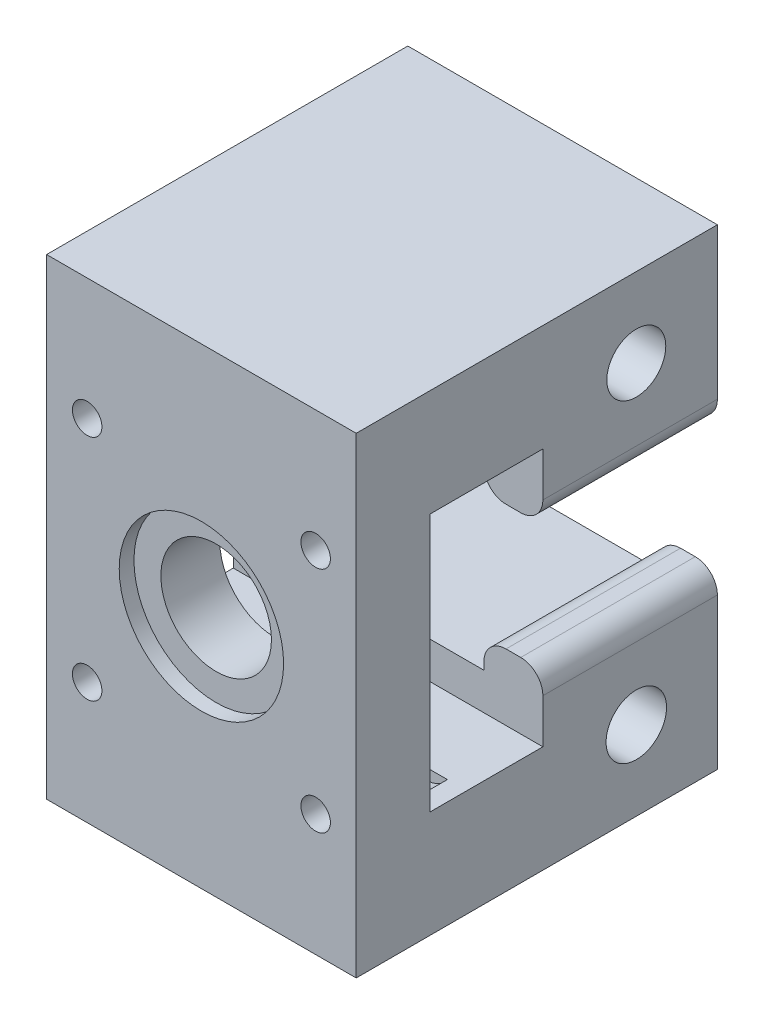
ISO-10303-21;
HEADER;
FILE_DESCRIPTION(('STEP AP214'),'2;1');
FILE_NAME('part.step','',(''),(''),'','','');
FILE_SCHEMA(('AUTOMOTIVE_DESIGN { 1 0 10303 214 1 1 1 1 }'));
ENDSEC;
DATA;
#1=APPLICATION_CONTEXT('core data for automotive mechanical design processes');
#2=APPLICATION_PROTOCOL_DEFINITION('international standard','automotive_design',2000,#1);
#3=PRODUCT_CONTEXT('',#1,'mechanical');
#4=PRODUCT('Part','Part','',(#3));
#5=PRODUCT_RELATED_PRODUCT_CATEGORY('part','',(#4));
#6=PRODUCT_DEFINITION_FORMATION('','',#4);
#7=PRODUCT_DEFINITION_CONTEXT('part definition',#1,'design');
#8=PRODUCT_DEFINITION('design','',#6,#7);
#9=PRODUCT_DEFINITION_SHAPE('','',#8);
#10=(LENGTH_UNIT() NAMED_UNIT(*) SI_UNIT(.MILLI.,.METRE.));
#11=(NAMED_UNIT(*) PLANE_ANGLE_UNIT() SI_UNIT($,.RADIAN.));
#12=(NAMED_UNIT(*) SI_UNIT($,.STERADIAN.) SOLID_ANGLE_UNIT());
#13=UNCERTAINTY_MEASURE_WITH_UNIT(LENGTH_MEASURE(1.E-05),#10,'distance_accuracy_value','');
#14=(GEOMETRIC_REPRESENTATION_CONTEXT(3) GLOBAL_UNCERTAINTY_ASSIGNED_CONTEXT((#13)) GLOBAL_UNIT_ASSIGNED_CONTEXT((#10,
#11,#12)) REPRESENTATION_CONTEXT('',''));
#15=CARTESIAN_POINT('',(0.,0.,0.));
#16=DIRECTION('',(0.,0.,1.));
#17=DIRECTION('',(1.,0.,0.));
#18=AXIS2_PLACEMENT_3D('',#15,#16,#17);
#19=CARTESIAN_POINT('',(75.2161760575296,-30.6161590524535,0.));
#20=DIRECTION('',(0.,-1.,0.));
#21=DIRECTION('',(1.,0.,0.));
#22=AXIS2_PLACEMENT_3D('',#19,#20,#21);
#23=PLANE('',#22);
#24=DIRECTION('',(0.,0.,1.));
#25=VECTOR('',#24,1.);
#26=CARTESIAN_POINT('',(72.5884073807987,-30.6161590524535,5.));
#27=LINE('',#26,#25);
#28=CARTESIAN_POINT('',(72.5884073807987,-30.6161590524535,10.));
#29=VERTEX_POINT('',#28);
#30=CARTESIAN_POINT('',(72.5884073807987,-30.6161590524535,5.));
#31=VERTEX_POINT('',#30);
#32=EDGE_CURVE('E225',#29,#31,#27,.F.);
#33=ORIENTED_EDGE('',*,*,#32,.F.);
#34=DIRECTION('',(-1.,0.,0.));
#35=VECTOR('',#34,1.);
#36=CARTESIAN_POINT('',(75.2161260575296,-30.6161590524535,10.));
#37=LINE('',#36,#35);
#38=CARTESIAN_POINT('',(75.2161260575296,-30.6161590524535,10.));
#39=VERTEX_POINT('',#38);
#40=EDGE_CURVE('E237',#39,#29,#37,.T.);
#41=ORIENTED_EDGE('',*,*,#40,.F.);
#42=DIRECTION('',(0.,0.,1.));
#43=VECTOR('',#42,1.);
#44=CARTESIAN_POINT('',(75.2161260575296,-30.6161590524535,10.));
#45=LINE('',#44,#43);
#46=CARTESIAN_POINT('',(75.2161260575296,-30.6161590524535,-5.32347531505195));
#47=VERTEX_POINT('',#46);
#48=EDGE_CURVE('E374',#47,#39,#45,.T.);
#49=ORIENTED_EDGE('',*,*,#48,.F.);
#50=DIRECTION('',(-1.,0.,0.));
#51=VECTOR('',#50,1.);
#52=CARTESIAN_POINT('',(75.2161760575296,-30.6161590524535,-5.32347531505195));
#53=LINE('',#52,#51);
#54=CARTESIAN_POINT('',(33.2161260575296,-30.6161590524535,-5.32347531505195));
#55=VERTEX_POINT('',#54);
#56=EDGE_CURVE('E341',#47,#55,#53,.T.);
#57=ORIENTED_EDGE('',*,*,#56,.T.);
#58=DIRECTION('',(0.,0.,1.));
#59=VECTOR('',#58,1.);
#60=CARTESIAN_POINT('',(33.2161260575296,-30.6161590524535,0.));
#61=LINE('',#60,#59);
#62=CARTESIAN_POINT('',(33.2161260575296,-30.6161590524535,10.));
#63=VERTEX_POINT('',#62);
#64=EDGE_CURVE('E338',#55,#63,#61,.T.);
#65=ORIENTED_EDGE('',*,*,#64,.T.);
#66=CARTESIAN_POINT('',(35.8438447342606,-30.6161590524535,10.));
#67=VERTEX_POINT('',#66);
#68=EDGE_CURVE('E248',#67,#63,#37,.T.);
#69=ORIENTED_EDGE('',*,*,#68,.F.);
#70=DIRECTION('',(0.,0.,1.));
#71=VECTOR('',#70,1.);
#72=CARTESIAN_POINT('',(35.8438447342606,-30.6161590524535,5.));
#73=LINE('',#72,#71);
#74=CARTESIAN_POINT('',(35.8438447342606,-30.6161590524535,5.));
#75=VERTEX_POINT('',#74);
#76=EDGE_CURVE('E321',#75,#67,#73,.T.);
#77=ORIENTED_EDGE('',*,*,#76,.F.);
#78=DIRECTION('',(1.,0.,0.));
#79=VECTOR('',#78,1.);
#80=CARTESIAN_POINT('',(75.2161760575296,-30.6161590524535,5.));
#81=LINE('',#80,#79);
#82=CARTESIAN_POINT('',(41.5884073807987,-30.6161590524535,5.));
#83=VERTEX_POINT('',#82);
#84=EDGE_CURVE('E44',#75,#83,#81,.T.);
#85=ORIENTED_EDGE('',*,*,#84,.T.);
#86=DIRECTION('',(0.,0.,1.));
#87=VECTOR('',#86,1.);
#88=CARTESIAN_POINT('',(41.5884073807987,-30.6161590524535,5.));
#89=LINE('',#88,#87);
#90=CARTESIAN_POINT('',(41.5884073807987,-30.6161590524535,10.));
#91=VERTEX_POINT('',#90);
#92=EDGE_CURVE('E317',#91,#83,#89,.F.);
#93=ORIENTED_EDGE('',*,*,#92,.F.);
#94=CARTESIAN_POINT('',(66.8438447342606,-30.6161590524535,10.));
#95=VERTEX_POINT('',#94);
#96=EDGE_CURVE('E246',#95,#91,#37,.T.);
#97=ORIENTED_EDGE('',*,*,#96,.F.);
#98=DIRECTION('',(0.,0.,1.));
#99=VECTOR('',#98,1.);
#100=CARTESIAN_POINT('',(66.8438447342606,-30.6161590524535,5.));
#101=LINE('',#100,#99);
#102=CARTESIAN_POINT('',(66.8438447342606,-30.6161590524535,5.));
#103=VERTEX_POINT('',#102);
#104=EDGE_CURVE('E228',#103,#95,#101,.T.);
#105=ORIENTED_EDGE('',*,*,#104,.F.);
#106=DIRECTION('',(1.,0.,0.));
#107=VECTOR('',#106,1.);
#108=CARTESIAN_POINT('',(75.2161760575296,-30.6161590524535,5.));
#109=LINE('',#108,#107);
#110=EDGE_CURVE('E12',#103,#31,#109,.T.);
#111=ORIENTED_EDGE('',*,*,#110,.T.);
#112=EDGE_LOOP('',(#33,#41,#49,#57,#65,#69,#77,#85,#93,#97,#105,#111));
#113=FACE_BOUND('',#112,.T.);
#114=ADVANCED_FACE('F36',(#113),#23,.F.);
#115=CARTESIAN_POINT('',(75.2161760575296,4.38384094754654,0.));
#116=DIRECTION('',(0.,1.,0.));
#117=DIRECTION('',(-1.,0.,0.));
#118=AXIS2_PLACEMENT_3D('',#115,#116,#117);
#119=PLANE('',#118);
#120=DIRECTION('',(0.,0.,1.));
#121=VECTOR('',#120,1.);
#122=CARTESIAN_POINT('',(35.8438447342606,4.38384094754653,5.));
#123=LINE('',#122,#121);
#124=CARTESIAN_POINT('',(35.8438447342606,4.38384094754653,10.));
#125=VERTEX_POINT('',#124);
#126=CARTESIAN_POINT('',(35.8438447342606,4.38384094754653,5.));
#127=VERTEX_POINT('',#126);
#128=EDGE_CURVE('E307',#125,#127,#123,.F.);
#129=ORIENTED_EDGE('',*,*,#128,.F.);
#130=DIRECTION('',(1.,0.,0.));
#131=VECTOR('',#130,1.);
#132=CARTESIAN_POINT('',(75.2161260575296,4.38384094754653,10.));
#133=LINE('',#132,#131);
#134=CARTESIAN_POINT('',(33.2161260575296,4.38384094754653,10.));
#135=VERTEX_POINT('',#134);
#136=EDGE_CURVE('E354',#135,#125,#133,.T.);
#137=ORIENTED_EDGE('',*,*,#136,.F.);
#138=DIRECTION('',(0.,0.,-1.));
#139=VECTOR('',#138,1.);
#140=CARTESIAN_POINT('',(33.2161260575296,4.38384094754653,0.));
#141=LINE('',#140,#139);
#142=CARTESIAN_POINT('',(33.2161260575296,4.38384094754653,-5.32347531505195));
#143=VERTEX_POINT('',#142);
#144=EDGE_CURVE('E351',#135,#143,#141,.T.);
#145=ORIENTED_EDGE('',*,*,#144,.T.);
#146=DIRECTION('',(-1.,0.,0.));
#147=VECTOR('',#146,1.);
#148=CARTESIAN_POINT('',(75.2161760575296,4.38384094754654,-5.32347531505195));
#149=LINE('',#148,#147);
#150=CARTESIAN_POINT('',(75.2161260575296,4.38384094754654,-5.32347531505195));
#151=VERTEX_POINT('',#150);
#152=EDGE_CURVE('E344',#151,#143,#149,.T.);
#153=ORIENTED_EDGE('',*,*,#152,.F.);
#154=DIRECTION('',(0.,0.,-1.));
#155=VECTOR('',#154,1.);
#156=CARTESIAN_POINT('',(75.2161260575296,4.38384094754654,10.));
#157=LINE('',#156,#155);
#158=CARTESIAN_POINT('',(75.2161260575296,4.38384094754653,10.));
#159=VERTEX_POINT('',#158);
#160=EDGE_CURVE('E371',#159,#151,#157,.T.);
#161=ORIENTED_EDGE('',*,*,#160,.F.);
#162=CARTESIAN_POINT('',(72.5241723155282,4.38384094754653,10.));
#163=VERTEX_POINT('',#162);
#164=EDGE_CURVE('E250',#163,#159,#133,.T.);
#165=ORIENTED_EDGE('',*,*,#164,.F.);
#166=DIRECTION('',(0.,0.,1.));
#167=VECTOR('',#166,1.);
#168=CARTESIAN_POINT('',(72.5241723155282,4.38384094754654,5.));
#169=LINE('',#168,#167);
#170=CARTESIAN_POINT('',(72.5241723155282,4.38384094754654,5.));
#171=VERTEX_POINT('',#170);
#172=EDGE_CURVE('E301',#171,#163,#169,.T.);
#173=ORIENTED_EDGE('',*,*,#172,.F.);
#174=DIRECTION('',(-1.,0.,0.));
#175=VECTOR('',#174,1.);
#176=CARTESIAN_POINT('',(75.2161760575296,4.38384094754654,5.));
#177=LINE('',#176,#175);
#178=CARTESIAN_POINT('',(66.9080797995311,4.38384094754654,5.));
#179=VERTEX_POINT('',#178);
#180=EDGE_CURVE('E422',#171,#179,#177,.T.);
#181=ORIENTED_EDGE('',*,*,#180,.T.);
#182=DIRECTION('',(0.,0.,1.));
#183=VECTOR('',#182,1.);
#184=CARTESIAN_POINT('',(66.9080797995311,4.38384094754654,5.));
#185=LINE('',#184,#183);
#186=CARTESIAN_POINT('',(66.9080797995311,4.38384094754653,10.));
#187=VERTEX_POINT('',#186);
#188=EDGE_CURVE('E297',#187,#179,#185,.F.);
#189=ORIENTED_EDGE('',*,*,#188,.F.);
#190=CARTESIAN_POINT('',(41.5884073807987,4.38384094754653,10.));
#191=VERTEX_POINT('',#190);
#192=EDGE_CURVE('E361',#191,#187,#133,.T.);
#193=ORIENTED_EDGE('',*,*,#192,.F.);
#194=DIRECTION('',(0.,0.,1.));
#195=VECTOR('',#194,1.);
#196=CARTESIAN_POINT('',(41.5884073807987,4.38384094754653,5.));
#197=LINE('',#196,#195);
#198=CARTESIAN_POINT('',(41.5884073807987,4.38384094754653,5.));
#199=VERTEX_POINT('',#198);
#200=EDGE_CURVE('E311',#199,#191,#197,.T.);
#201=ORIENTED_EDGE('',*,*,#200,.F.);
#202=DIRECTION('',(-1.,0.,0.));
#203=VECTOR('',#202,1.);
#204=CARTESIAN_POINT('',(75.2161760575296,4.38384094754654,5.));
#205=LINE('',#204,#203);
#206=EDGE_CURVE('E425',#199,#127,#205,.T.);
#207=ORIENTED_EDGE('',*,*,#206,.T.);
#208=EDGE_LOOP('',(#129,#137,#145,#153,#161,#165,#173,#181,#189,#193,#201,#207));
#209=FACE_BOUND('',#208,.T.);
#210=ADVANCED_FACE('F357',(#209),#119,.F.);
#211=CARTESIAN_POINT('',(33.2161260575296,18.8838409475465,10.));
#212=DIRECTION('',(1.,0.,0.));
#213=DIRECTION('',(0.,1.,0.));
#214=AXIS2_PLACEMENT_3D('',#211,#212,#213);
#215=PLANE('',#214);
#216=CARTESIAN_POINT('',(33.2161260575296,-34.3661590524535,-18.));
#217=DIRECTION('',(1.,0.,0.));
#218=DIRECTION('',(0.,0.,-1.));
#219=AXIS2_PLACEMENT_3D('',#216,#217,#218);
#220=CIRCLE('',#219,4.1);
#221=CARTESIAN_POINT('',(33.2161260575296,-34.3661590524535,-22.1));
#222=VERTEX_POINT('',#221);
#223=EDGE_CURVE('E543',#222,#222,#220,.T.);
#224=ORIENTED_EDGE('',*,*,#223,.T.);
#225=EDGE_LOOP('',(#224));
#226=FACE_BOUND('',#225,.T.);
#227=CARTESIAN_POINT('',(33.2161260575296,8.13384094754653,-18.));
#228=DIRECTION('',(1.,0.,0.));
#229=DIRECTION('',(0.,0.,-1.));
#230=AXIS2_PLACEMENT_3D('',#227,#228,#229);
#231=CIRCLE('',#230,4.);
#232=CARTESIAN_POINT('',(33.2161260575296,8.13384094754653,-22.));
#233=VERTEX_POINT('',#232);
#234=EDGE_CURVE('E549',#233,#233,#231,.T.);
#235=ORIENTED_EDGE('',*,*,#234,.T.);
#236=EDGE_LOOP('',(#235));
#237=FACE_BOUND('',#236,.T.);
#238=DIRECTION('',(0.,0.,-1.));
#239=VECTOR('',#238,1.);
#240=CARTESIAN_POINT('',(33.2161260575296,-0.61615905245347,10.));
#241=LINE('',#240,#239);
#242=CARTESIAN_POINT('',(33.2161260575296,-0.616159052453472,-5.32347531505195));
#243=VERTEX_POINT('',#242);
#244=CARTESIAN_POINT('',(33.2161260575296,-0.61615905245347,-29.));
#245=VERTEX_POINT('',#244);
#246=EDGE_CURVE('E272',#243,#245,#241,.T.);
#247=ORIENTED_EDGE('',*,*,#246,.F.);
#248=DIRECTION('',(0.,-1.,0.));
#249=VECTOR('',#248,1.);
#250=CARTESIAN_POINT('',(33.2161260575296,4.38384094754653,-5.32347531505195));
#251=LINE('',#250,#249);
#252=EDGE_CURVE('E345',#143,#243,#251,.T.);
#253=ORIENTED_EDGE('',*,*,#252,.F.);
#254=ORIENTED_EDGE('',*,*,#144,.F.);
#255=DIRECTION('',(0.,1.,0.));
#256=VECTOR('',#255,1.);
#257=CARTESIAN_POINT('',(33.2161260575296,-30.6161590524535,10.));
#258=LINE('',#257,#256);
#259=EDGE_CURVE('E245',#63,#135,#258,.T.);
#260=ORIENTED_EDGE('',*,*,#259,.F.);
#261=ORIENTED_EDGE('',*,*,#64,.F.);
#262=CARTESIAN_POINT('',(33.2161260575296,-25.6161590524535,-5.32347531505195));
#263=VERTEX_POINT('',#262);
#264=EDGE_CURVE('E555',#263,#55,#251,.T.);
#265=ORIENTED_EDGE('',*,*,#264,.F.);
#266=DIRECTION('',(0.,0.,1.));
#267=VECTOR('',#266,1.);
#268=CARTESIAN_POINT('',(33.2161260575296,-25.6161590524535,10.));
#269=LINE('',#268,#267);
#270=CARTESIAN_POINT('',(33.2161260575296,-25.6161590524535,-29.));
#271=VERTEX_POINT('',#270);
#272=EDGE_CURVE('E269',#271,#263,#269,.T.);
#273=ORIENTED_EDGE('',*,*,#272,.F.);
#274=DIRECTION('',(0.,1.,0.));
#275=VECTOR('',#274,1.);
#276=CARTESIAN_POINT('',(33.2161260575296,-27.1161590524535,-29.));
#277=LINE('',#276,#275);
#278=CARTESIAN_POINT('',(33.2161260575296,-45.1161590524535,-29.));
#279=VERTEX_POINT('',#278);
#280=EDGE_CURVE('E539',#279,#271,#277,.T.);
#281=ORIENTED_EDGE('',*,*,#280,.F.);
#282=DIRECTION('',(0.,0.,-1.));
#283=VECTOR('',#282,1.);
#284=CARTESIAN_POINT('',(33.2161260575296,-45.1161590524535,10.));
#285=LINE('',#284,#283);
#286=CARTESIAN_POINT('',(33.2161260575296,-45.1161590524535,20.));
#287=VERTEX_POINT('',#286);
#288=EDGE_CURVE('E375',#287,#279,#285,.T.);
#289=ORIENTED_EDGE('',*,*,#288,.F.);
#290=DIRECTION('',(0.,-1.,0.));
#291=VECTOR('',#290,1.);
#292=CARTESIAN_POINT('',(33.2161260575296,-45.1161590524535,20.));
#293=LINE('',#292,#291);
#294=CARTESIAN_POINT('',(33.2161260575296,18.8838409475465,20.));
#295=VERTEX_POINT('',#294);
#296=EDGE_CURVE('E360',#295,#287,#293,.T.);
#297=ORIENTED_EDGE('',*,*,#296,.F.);
#298=DIRECTION('',(0.,0.,-1.));
#299=VECTOR('',#298,1.);
#300=CARTESIAN_POINT('',(33.2161260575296,18.8838409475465,10.));
#301=LINE('',#300,#299);
#302=CARTESIAN_POINT('',(33.2161260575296,18.8838409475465,-29.));
#303=VERTEX_POINT('',#302);
#304=EDGE_CURVE('E562',#295,#303,#301,.T.);
#305=ORIENTED_EDGE('',*,*,#304,.T.);
#306=DIRECTION('',(0.,1.,0.));
#307=VECTOR('',#306,1.);
#308=CARTESIAN_POINT('',(33.2161260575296,18.8838409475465,-29.));
#309=LINE('',#308,#307);
#310=EDGE_CURVE('E527',#245,#303,#309,.T.);
#311=ORIENTED_EDGE('',*,*,#310,.F.);
#312=EDGE_LOOP('',(#247,#253,#254,#260,#261,#265,#273,#281,#289,#297,#305,#311));
#313=FACE_BOUND('',#312,.T.);
#314=ADVANCED_FACE('F348',(#226,#237,#313),#215,.F.);
#315=CARTESIAN_POINT('',(75.2161760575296,4.38384094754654,-5.32347531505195));
#316=DIRECTION('',(0.,0.,-1.));
#317=DIRECTION('',(0.,1.,0.));
#318=AXIS2_PLACEMENT_3D('',#315,#316,#317);
#319=PLANE('',#318);
#320=ORIENTED_EDGE('',*,*,#252,.T.);
#321=DIRECTION('',(-1.,0.,0.));
#322=VECTOR('',#321,1.);
#323=CARTESIAN_POINT('',(33.2161260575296,-0.616159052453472,-5.32347531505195));
#324=LINE('',#323,#322);
#325=CARTESIAN_POINT('',(67.2161260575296,-0.616159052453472,-5.32347531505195));
#326=VERTEX_POINT('',#325);
#327=EDGE_CURVE('E525',#326,#243,#324,.T.);
#328=ORIENTED_EDGE('',*,*,#327,.F.);
#329=DIRECTION('',(0.,1.,0.));
#330=VECTOR('',#329,1.);
#331=CARTESIAN_POINT('',(67.2161260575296,-4.61615905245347,-5.32347531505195));
#332=LINE('',#331,#330);
#333=CARTESIAN_POINT('',(67.2161260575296,-1.61615905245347,-5.32347531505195));
#334=VERTEX_POINT('',#333);
#335=EDGE_CURVE('E509',#334,#326,#332,.T.);
#336=ORIENTED_EDGE('',*,*,#335,.F.);
#337=CARTESIAN_POINT('',(70.2161260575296,-1.61615905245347,-5.32347531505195));
#338=DIRECTION('',(0.,0.,-1.));
#339=DIRECTION('',(0.,1.,0.));
#340=AXIS2_PLACEMENT_3D('',#337,#338,#339);
#341=CIRCLE('',#340,3.);
#342=CARTESIAN_POINT('',(70.2161260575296,-4.61615905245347,-5.32347531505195));
#343=VERTEX_POINT('',#342);
#344=EDGE_CURVE('E410',#334,#343,#341,.F.);
#345=ORIENTED_EDGE('',*,*,#344,.T.);
#346=DIRECTION('',(-1.,0.,0.));
#347=VECTOR('',#346,1.);
#348=CARTESIAN_POINT('',(75.2161260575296,-4.61615905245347,-5.32347531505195));
#349=LINE('',#348,#347);
#350=CARTESIAN_POINT('',(72.2161260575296,-4.61615905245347,-5.32347531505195));
#351=VERTEX_POINT('',#350);
#352=EDGE_CURVE('E505',#351,#343,#349,.T.);
#353=ORIENTED_EDGE('',*,*,#352,.F.);
#354=CARTESIAN_POINT('',(72.2161260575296,-1.61615905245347,-5.32347531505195));
#355=DIRECTION('',(0.,0.,-1.));
#356=DIRECTION('',(0.,1.,0.));
#357=AXIS2_PLACEMENT_3D('',#354,#355,#356);
#358=CIRCLE('',#357,3.);
#359=CARTESIAN_POINT('',(75.2161260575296,-1.61615905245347,-5.32347531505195));
#360=VERTEX_POINT('',#359);
#361=EDGE_CURVE('E58',#351,#360,#358,.F.);
#362=ORIENTED_EDGE('',*,*,#361,.T.);
#363=DIRECTION('',(0.,-1.,0.));
#364=VECTOR('',#363,1.);
#365=CARTESIAN_POINT('',(75.2161260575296,18.8838409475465,-5.32347531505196));
#366=LINE('',#365,#364);
#367=EDGE_CURVE('E561',#151,#360,#366,.T.);
#368=ORIENTED_EDGE('',*,*,#367,.F.);
#369=ORIENTED_EDGE('',*,*,#152,.T.);
#370=EDGE_LOOP('',(#320,#328,#336,#345,#353,#362,#368,#369));
#371=FACE_BOUND('',#370,.T.);
#372=ADVANCED_FACE('F462',(#371),#319,.F.);
#373=CARTESIAN_POINT('',(0.,0.,-29.));
#374=DIRECTION('',(0.,0.,1.));
#375=DIRECTION('',(1.,0.,0.));
#376=AXIS2_PLACEMENT_3D('',#373,#374,#375);
#377=PLANE('',#376);
#378=DIRECTION('',(1.,0.,0.));
#379=VECTOR('',#378,1.);
#380=CARTESIAN_POINT('',(33.2161260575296,-0.616159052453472,-29.));
#381=LINE('',#380,#379);
#382=CARTESIAN_POINT('',(67.2161260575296,-0.616159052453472,-29.));
#383=VERTEX_POINT('',#382);
#384=EDGE_CURVE('E523',#245,#383,#381,.T.);
#385=ORIENTED_EDGE('',*,*,#384,.F.);
#386=ORIENTED_EDGE('',*,*,#310,.T.);
#387=DIRECTION('',(1.,0.,0.));
#388=VECTOR('',#387,1.);
#389=CARTESIAN_POINT('',(33.2161260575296,18.8838409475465,-29.));
#390=LINE('',#389,#388);
#391=CARTESIAN_POINT('',(75.2161260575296,18.8838409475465,-29.));
#392=VERTEX_POINT('',#391);
#393=EDGE_CURVE('E529',#303,#392,#390,.T.);
#394=ORIENTED_EDGE('',*,*,#393,.T.);
#395=DIRECTION('',(0.,-1.,0.));
#396=VECTOR('',#395,1.);
#397=CARTESIAN_POINT('',(75.2161260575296,18.8838409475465,-29.));
#398=LINE('',#397,#396);
#399=CARTESIAN_POINT('',(75.2161260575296,-1.61615905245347,-29.));
#400=VERTEX_POINT('',#399);
#401=EDGE_CURVE('E532',#392,#400,#398,.T.);
#402=ORIENTED_EDGE('',*,*,#401,.T.);
#403=CARTESIAN_POINT('',(72.2161260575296,-1.61615905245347,-29.));
#404=DIRECTION('',(0.,0.,1.));
#405=DIRECTION('',(1.,0.,0.));
#406=AXIS2_PLACEMENT_3D('',#403,#404,#405);
#407=CIRCLE('',#406,3.);
#408=CARTESIAN_POINT('',(72.2161260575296,-4.61615905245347,-29.));
#409=VERTEX_POINT('',#408);
#410=EDGE_CURVE('E51',#400,#409,#407,.F.);
#411=ORIENTED_EDGE('',*,*,#410,.T.);
#412=DIRECTION('',(1.,0.,0.));
#413=VECTOR('',#412,1.);
#414=CARTESIAN_POINT('',(75.2161260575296,-4.61615905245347,-29.));
#415=LINE('',#414,#413);
#416=CARTESIAN_POINT('',(70.2161260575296,-4.61615905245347,-29.));
#417=VERTEX_POINT('',#416);
#418=EDGE_CURVE('E503',#417,#409,#415,.T.);
#419=ORIENTED_EDGE('',*,*,#418,.F.);
#420=CARTESIAN_POINT('',(70.2161260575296,-1.61615905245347,-29.));
#421=DIRECTION('',(0.,0.,1.));
#422=DIRECTION('',(1.,0.,0.));
#423=AXIS2_PLACEMENT_3D('',#420,#421,#422);
#424=CIRCLE('',#423,3.);
#425=CARTESIAN_POINT('',(67.2161260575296,-1.61615905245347,-29.));
#426=VERTEX_POINT('',#425);
#427=EDGE_CURVE('E413',#417,#426,#424,.F.);
#428=ORIENTED_EDGE('',*,*,#427,.T.);
#429=DIRECTION('',(0.,1.,0.));
#430=VECTOR('',#429,1.);
#431=CARTESIAN_POINT('',(67.2161260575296,-4.61615905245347,-29.));
#432=LINE('',#431,#430);
#433=EDGE_CURVE('E507',#426,#383,#432,.T.);
#434=ORIENTED_EDGE('',*,*,#433,.T.);
#435=EDGE_LOOP('',(#385,#386,#394,#402,#411,#419,#428,#434));
#436=FACE_BOUND('',#435,.T.);
#437=ADVANCED_FACE('F464',(#436),#377,.F.);
#438=DIRECTION('',(1.,0.,0.));
#439=VECTOR('',#438,1.);
#440=CARTESIAN_POINT('',(33.2161260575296,-25.6161590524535,-5.32347531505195));
#441=LINE('',#440,#439);
#442=CARTESIAN_POINT('',(67.2161260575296,-25.6161590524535,-5.32347531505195));
#443=VERTEX_POINT('',#442);
#444=EDGE_CURVE('E519',#263,#443,#441,.T.);
#445=ORIENTED_EDGE('',*,*,#444,.F.);
#446=ORIENTED_EDGE('',*,*,#264,.T.);
#447=ORIENTED_EDGE('',*,*,#56,.F.);
#448=CARTESIAN_POINT('',(75.2161260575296,-24.6161590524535,-5.32347531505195));
#449=VERTEX_POINT('',#448);
#450=EDGE_CURVE('E380',#449,#47,#366,.T.);
#451=ORIENTED_EDGE('',*,*,#450,.F.);
#452=CARTESIAN_POINT('',(72.2161260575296,-24.6161590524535,-5.32347531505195));
#453=DIRECTION('',(0.,0.,-1.));
#454=DIRECTION('',(0.,1.,0.));
#455=AXIS2_PLACEMENT_3D('',#452,#453,#454);
#456=CIRCLE('',#455,3.);
#457=CARTESIAN_POINT('',(72.2161260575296,-21.6161590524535,-5.32347531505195));
#458=VERTEX_POINT('',#457);
#459=EDGE_CURVE('E383',#449,#458,#456,.F.);
#460=ORIENTED_EDGE('',*,*,#459,.T.);
#461=DIRECTION('',(1.,0.,0.));
#462=VECTOR('',#461,1.);
#463=CARTESIAN_POINT('',(75.2161260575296,-21.6161590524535,-5.32347531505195));
#464=LINE('',#463,#462);
#465=CARTESIAN_POINT('',(70.2161260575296,-21.6161590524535,-5.32347531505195));
#466=VERTEX_POINT('',#465);
#467=EDGE_CURVE('E588',#466,#458,#464,.T.);
#468=ORIENTED_EDGE('',*,*,#467,.F.);
#469=CARTESIAN_POINT('',(70.2161260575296,-24.6161590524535,-5.32347531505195));
#470=DIRECTION('',(0.,0.,-1.));
#471=DIRECTION('',(0.,1.,0.));
#472=AXIS2_PLACEMENT_3D('',#469,#470,#471);
#473=CIRCLE('',#472,3.);
#474=CARTESIAN_POINT('',(67.2161260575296,-24.6161590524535,-5.32347531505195));
#475=VERTEX_POINT('',#474);
#476=EDGE_CURVE('E402',#466,#475,#473,.F.);
#477=ORIENTED_EDGE('',*,*,#476,.T.);
#478=DIRECTION('',(0.,-1.,0.));
#479=VECTOR('',#478,1.);
#480=CARTESIAN_POINT('',(67.2161260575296,-21.6161590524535,-5.32347531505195));
#481=LINE('',#480,#479);
#482=EDGE_CURVE('E587',#475,#443,#481,.T.);
#483=ORIENTED_EDGE('',*,*,#482,.T.);
#484=EDGE_LOOP('',(#445,#446,#447,#451,#460,#468,#477,#483));
#485=FACE_BOUND('',#484,.T.);
#486=ADVANCED_FACE('F466',(#485),#319,.F.);
#487=CARTESIAN_POINT('',(0.,0.,-29.));
#488=DIRECTION('',(0.,0.,-1.));
#489=DIRECTION('',(-1.,0.,0.));
#490=AXIS2_PLACEMENT_3D('',#487,#488,#489);
#491=PLANE('',#490);
#492=ORIENTED_EDGE('',*,*,#280,.T.);
#493=DIRECTION('',(-1.,0.,0.));
#494=VECTOR('',#493,1.);
#495=CARTESIAN_POINT('',(33.2161260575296,-25.6161590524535,-29.));
#496=LINE('',#495,#494);
#497=CARTESIAN_POINT('',(67.2161260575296,-25.6161590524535,-29.));
#498=VERTEX_POINT('',#497);
#499=EDGE_CURVE('E521',#498,#271,#496,.T.);
#500=ORIENTED_EDGE('',*,*,#499,.F.);
#501=DIRECTION('',(0.,-1.,0.));
#502=VECTOR('',#501,1.);
#503=CARTESIAN_POINT('',(67.2161260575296,-21.6161590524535,-29.));
#504=LINE('',#503,#502);
#505=CARTESIAN_POINT('',(67.2161260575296,-24.6161590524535,-29.));
#506=VERTEX_POINT('',#505);
#507=EDGE_CURVE('E516',#506,#498,#504,.T.);
#508=ORIENTED_EDGE('',*,*,#507,.F.);
#509=CARTESIAN_POINT('',(70.2161260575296,-24.6161590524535,-29.));
#510=DIRECTION('',(0.,0.,-1.));
#511=DIRECTION('',(-1.,0.,0.));
#512=AXIS2_PLACEMENT_3D('',#509,#510,#511);
#513=CIRCLE('',#512,3.);
#514=CARTESIAN_POINT('',(70.2161260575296,-21.6161590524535,-29.));
#515=VERTEX_POINT('',#514);
#516=EDGE_CURVE('E400',#506,#515,#513,.T.);
#517=ORIENTED_EDGE('',*,*,#516,.T.);
#518=DIRECTION('',(-1.,0.,0.));
#519=VECTOR('',#518,1.);
#520=CARTESIAN_POINT('',(75.2161260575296,-21.6161590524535,-29.));
#521=LINE('',#520,#519);
#522=CARTESIAN_POINT('',(72.2161260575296,-21.6161590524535,-29.));
#523=VERTEX_POINT('',#522);
#524=EDGE_CURVE('E592',#523,#515,#521,.T.);
#525=ORIENTED_EDGE('',*,*,#524,.F.);
#526=CARTESIAN_POINT('',(72.2161260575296,-24.6161590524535,-29.));
#527=DIRECTION('',(0.,0.,-1.));
#528=DIRECTION('',(-1.,0.,0.));
#529=AXIS2_PLACEMENT_3D('',#526,#527,#528);
#530=CIRCLE('',#529,3.);
#531=CARTESIAN_POINT('',(75.2161260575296,-24.6161590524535,-29.));
#532=VERTEX_POINT('',#531);
#533=EDGE_CURVE('E392',#523,#532,#530,.T.);
#534=ORIENTED_EDGE('',*,*,#533,.T.);
#535=DIRECTION('',(0.,-1.,0.));
#536=VECTOR('',#535,1.);
#537=CARTESIAN_POINT('',(75.2161260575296,-27.1161590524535,-29.));
#538=LINE('',#537,#536);
#539=CARTESIAN_POINT('',(75.2161260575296,-45.1161590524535,-29.));
#540=VERTEX_POINT('',#539);
#541=EDGE_CURVE('E534',#532,#540,#538,.T.);
#542=ORIENTED_EDGE('',*,*,#541,.T.);
#543=DIRECTION('',(-1.,0.,0.));
#544=VECTOR('',#543,1.);
#545=CARTESIAN_POINT('',(75.2161260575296,-45.1161590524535,-29.));
#546=LINE('',#545,#544);
#547=EDGE_CURVE('E536',#540,#279,#546,.T.);
#548=ORIENTED_EDGE('',*,*,#547,.T.);
#549=EDGE_LOOP('',(#492,#500,#508,#517,#525,#534,#542,#548));
#550=FACE_BOUND('',#549,.T.);
#551=ADVANCED_FACE('F497',(#550),#491,.T.);
#552=CARTESIAN_POINT('',(72.2161260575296,-1.61615905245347,10.));
#553=DIRECTION('',(0.,0.,1.));
#554=DIRECTION('',(1.,0.,0.));
#555=AXIS2_PLACEMENT_3D('',#552,#553,#554);
#556=CYLINDRICAL_SURFACE('',#555,3.);
#557=DIRECTION('',(0.,0.,-1.));
#558=VECTOR('',#557,1.);
#559=CARTESIAN_POINT('',(75.2161260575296,-1.61615905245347,10.));
#560=LINE('',#559,#558);
#561=EDGE_CURVE('E415',#360,#400,#560,.T.);
#562=ORIENTED_EDGE('',*,*,#561,.F.);
#563=ORIENTED_EDGE('',*,*,#361,.F.);
#564=DIRECTION('',(0.,0.,-1.));
#565=VECTOR('',#564,1.);
#566=CARTESIAN_POINT('',(72.2161260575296,-4.61615905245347,10.));
#567=LINE('',#566,#565);
#568=EDGE_CURVE('E418',#409,#351,#567,.F.);
#569=ORIENTED_EDGE('',*,*,#568,.F.);
#570=ORIENTED_EDGE('',*,*,#410,.F.);
#571=EDGE_LOOP('',(#562,#563,#569,#570));
#572=FACE_BOUND('',#571,.T.);
#573=ADVANCED_FACE('F38',(#572),#556,.T.);
#574=CARTESIAN_POINT('',(70.2161260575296,-1.61615905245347,0.));
#575=DIRECTION('',(0.,0.,1.));
#576=DIRECTION('',(1.,0.,0.));
#577=AXIS2_PLACEMENT_3D('',#574,#575,#576);
#578=CYLINDRICAL_SURFACE('',#577,3.);
#579=DIRECTION('',(0.,0.,-1.));
#580=VECTOR('',#579,1.);
#581=CARTESIAN_POINT('',(70.2161260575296,-4.61615905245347,0.));
#582=LINE('',#581,#580);
#583=EDGE_CURVE('E404',#343,#417,#582,.T.);
#584=ORIENTED_EDGE('',*,*,#583,.F.);
#585=ORIENTED_EDGE('',*,*,#344,.F.);
#586=DIRECTION('',(0.,0.,-1.));
#587=VECTOR('',#586,1.);
#588=CARTESIAN_POINT('',(67.2161260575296,-1.61615905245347,0.));
#589=LINE('',#588,#587);
#590=EDGE_CURVE('E407',#426,#334,#589,.F.);
#591=ORIENTED_EDGE('',*,*,#590,.F.);
#592=ORIENTED_EDGE('',*,*,#427,.F.);
#593=EDGE_LOOP('',(#584,#585,#591,#592));
#594=FACE_BOUND('',#593,.T.);
#595=ADVANCED_FACE('F490',(#594),#578,.T.);
#596=CARTESIAN_POINT('',(70.2161260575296,-24.6161590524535,0.));
#597=DIRECTION('',(0.,0.,1.));
#598=DIRECTION('',(1.,0.,0.));
#599=AXIS2_PLACEMENT_3D('',#596,#597,#598);
#600=CYLINDRICAL_SURFACE('',#599,3.);
#601=DIRECTION('',(0.,0.,1.));
#602=VECTOR('',#601,1.);
#603=CARTESIAN_POINT('',(70.2161260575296,-21.6161590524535,0.));
#604=LINE('',#603,#602);
#605=EDGE_CURVE('E394',#515,#466,#604,.T.);
#606=ORIENTED_EDGE('',*,*,#605,.F.);
#607=ORIENTED_EDGE('',*,*,#516,.F.);
#608=DIRECTION('',(0.,0.,1.));
#609=VECTOR('',#608,1.);
#610=CARTESIAN_POINT('',(67.2161260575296,-24.6161590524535,-29.));
#611=LINE('',#610,#609);
#612=EDGE_CURVE('E397',#475,#506,#611,.F.);
#613=ORIENTED_EDGE('',*,*,#612,.F.);
#614=ORIENTED_EDGE('',*,*,#476,.F.);
#615=EDGE_LOOP('',(#606,#607,#613,#614));
#616=FACE_BOUND('',#615,.T.);
#617=ADVANCED_FACE('F487',(#616),#600,.T.);
#618=CARTESIAN_POINT('',(72.2161260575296,-24.6161590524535,10.));
#619=DIRECTION('',(0.,0.,1.));
#620=DIRECTION('',(1.,0.,0.));
#621=AXIS2_PLACEMENT_3D('',#618,#619,#620);
#622=CYLINDRICAL_SURFACE('',#621,3.);
#623=DIRECTION('',(0.,0.,1.));
#624=VECTOR('',#623,1.);
#625=CARTESIAN_POINT('',(75.2161260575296,-24.6161590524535,10.));
#626=LINE('',#625,#624);
#627=EDGE_CURVE('E381',#532,#449,#626,.T.);
#628=ORIENTED_EDGE('',*,*,#627,.F.);
#629=ORIENTED_EDGE('',*,*,#533,.F.);
#630=DIRECTION('',(0.,0.,1.));
#631=VECTOR('',#630,1.);
#632=CARTESIAN_POINT('',(72.2161260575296,-21.6161590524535,0.));
#633=LINE('',#632,#631);
#634=EDGE_CURVE('E389',#458,#523,#633,.F.);
#635=ORIENTED_EDGE('',*,*,#634,.F.);
#636=ORIENTED_EDGE('',*,*,#459,.F.);
#637=EDGE_LOOP('',(#628,#629,#635,#636));
#638=FACE_BOUND('',#637,.T.);
#639=ADVANCED_FACE('F483',(#638),#622,.T.);
#640=CARTESIAN_POINT('',(0.,-25.6161590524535,0.));
#641=DIRECTION('',(0.,1.,0.));
#642=DIRECTION('',(0.,0.,1.));
#643=AXIS2_PLACEMENT_3D('',#640,#641,#642);
#644=PLANE('',#643);
#645=ORIENTED_EDGE('',*,*,#499,.T.);
#646=ORIENTED_EDGE('',*,*,#272,.T.);
#647=ORIENTED_EDGE('',*,*,#444,.T.);
#648=DIRECTION('',(0.,0.,1.));
#649=VECTOR('',#648,1.);
#650=CARTESIAN_POINT('',(67.2161260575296,-25.6161590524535,-29.));
#651=LINE('',#650,#649);
#652=EDGE_CURVE('E582',#498,#443,#651,.T.);
#653=ORIENTED_EDGE('',*,*,#652,.F.);
#654=EDGE_LOOP('',(#645,#646,#647,#653));
#655=FACE_BOUND('',#654,.T.);
#656=ADVANCED_FACE('F486',(#655),#644,.T.);
#657=CARTESIAN_POINT('',(0.,-0.616159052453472,0.));
#658=DIRECTION('',(0.,1.,0.));
#659=DIRECTION('',(0.,0.,1.));
#660=AXIS2_PLACEMENT_3D('',#657,#658,#659);
#661=PLANE('',#660);
#662=ORIENTED_EDGE('',*,*,#327,.T.);
#663=ORIENTED_EDGE('',*,*,#246,.T.);
#664=ORIENTED_EDGE('',*,*,#384,.T.);
#665=DIRECTION('',(0.,0.,-1.));
#666=VECTOR('',#665,1.);
#667=CARTESIAN_POINT('',(67.2161260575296,-0.616159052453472,-29.));
#668=LINE('',#667,#666);
#669=EDGE_CURVE('E511',#326,#383,#668,.T.);
#670=ORIENTED_EDGE('',*,*,#669,.F.);
#671=EDGE_LOOP('',(#662,#663,#664,#670));
#672=FACE_BOUND('',#671,.T.);
#673=ADVANCED_FACE('F478',(#672),#661,.F.);
#674=CARTESIAN_POINT('',(33.2161260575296,-45.1161590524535,10.));
#675=DIRECTION('',(0.,1.,0.));
#676=DIRECTION('',(0.,0.,1.));
#677=AXIS2_PLACEMENT_3D('',#674,#675,#676);
#678=PLANE('',#677);
#679=ORIENTED_EDGE('',*,*,#288,.T.);
#680=ORIENTED_EDGE('',*,*,#547,.F.);
#681=DIRECTION('',(0.,0.,-1.));
#682=VECTOR('',#681,1.);
#683=CARTESIAN_POINT('',(75.2161260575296,-45.1161590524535,10.));
#684=LINE('',#683,#682);
#685=CARTESIAN_POINT('',(75.2161260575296,-45.1161590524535,20.));
#686=VERTEX_POINT('',#685);
#687=EDGE_CURVE('E567',#686,#540,#684,.T.);
#688=ORIENTED_EDGE('',*,*,#687,.F.);
#689=DIRECTION('',(1.,0.,0.));
#690=VECTOR('',#689,1.);
#691=CARTESIAN_POINT('',(33.2161260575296,-45.1161590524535,20.));
#692=LINE('',#691,#690);
#693=EDGE_CURVE('E364',#287,#686,#692,.T.);
#694=ORIENTED_EDGE('',*,*,#693,.F.);
#695=EDGE_LOOP('',(#679,#680,#688,#694));
#696=FACE_BOUND('',#695,.T.);
#697=ADVANCED_FACE('F474',(#696),#678,.F.);
#698=CARTESIAN_POINT('',(75.2161260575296,18.8838409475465,10.));
#699=DIRECTION('',(-1.,0.,0.));
#700=DIRECTION('',(0.,0.,1.));
#701=AXIS2_PLACEMENT_3D('',#698,#699,#700);
#702=PLANE('',#701);
#703=CARTESIAN_POINT('',(75.2161260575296,-34.3661590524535,-18.));
#704=DIRECTION('',(1.,0.,0.));
#705=DIRECTION('',(0.,0.,-1.));
#706=AXIS2_PLACEMENT_3D('',#703,#704,#705);
#707=CIRCLE('',#706,4.1);
#708=CARTESIAN_POINT('',(75.2161260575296,-34.3661590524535,-22.1));
#709=VERTEX_POINT('',#708);
#710=EDGE_CURVE('E542',#709,#709,#707,.T.);
#711=ORIENTED_EDGE('',*,*,#710,.F.);
#712=EDGE_LOOP('',(#711));
#713=FACE_BOUND('',#712,.T.);
#714=CARTESIAN_POINT('',(75.2161260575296,8.13384094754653,-18.));
#715=DIRECTION('',(1.,0.,0.));
#716=DIRECTION('',(0.,0.,-1.));
#717=AXIS2_PLACEMENT_3D('',#714,#715,#716);
#718=CIRCLE('',#717,4.);
#719=CARTESIAN_POINT('',(75.2161260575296,8.13384094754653,-22.));
#720=VERTEX_POINT('',#719);
#721=EDGE_CURVE('E546',#720,#720,#718,.T.);
#722=ORIENTED_EDGE('',*,*,#721,.F.);
#723=EDGE_LOOP('',(#722));
#724=FACE_BOUND('',#723,.T.);
#725=DIRECTION('',(0.,-1.,0.));
#726=VECTOR('',#725,1.);
#727=CARTESIAN_POINT('',(75.2161260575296,-30.6161590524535,10.));
#728=LINE('',#727,#726);
#729=EDGE_CURVE('E244',#159,#39,#728,.T.);
#730=ORIENTED_EDGE('',*,*,#729,.F.);
#731=ORIENTED_EDGE('',*,*,#160,.T.);
#732=ORIENTED_EDGE('',*,*,#367,.T.);
#733=ORIENTED_EDGE('',*,*,#561,.T.);
#734=ORIENTED_EDGE('',*,*,#401,.F.);
#735=DIRECTION('',(0.,0.,-1.));
#736=VECTOR('',#735,1.);
#737=CARTESIAN_POINT('',(75.2161260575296,18.8838409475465,10.));
#738=LINE('',#737,#736);
#739=CARTESIAN_POINT('',(75.2161260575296,18.8838409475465,20.));
#740=VERTEX_POINT('',#739);
#741=EDGE_CURVE('E565',#740,#392,#738,.T.);
#742=ORIENTED_EDGE('',*,*,#741,.F.);
#743=DIRECTION('',(0.,1.,0.));
#744=VECTOR('',#743,1.);
#745=CARTESIAN_POINT('',(75.2161260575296,-45.1161590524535,20.));
#746=LINE('',#745,#744);
#747=EDGE_CURVE('E599',#686,#740,#746,.T.);
#748=ORIENTED_EDGE('',*,*,#747,.F.);
#749=ORIENTED_EDGE('',*,*,#687,.T.);
#750=ORIENTED_EDGE('',*,*,#541,.F.);
#751=ORIENTED_EDGE('',*,*,#627,.T.);
#752=ORIENTED_EDGE('',*,*,#450,.T.);
#753=ORIENTED_EDGE('',*,*,#48,.T.);
#754=EDGE_LOOP('',(#730,#731,#732,#733,#734,#742,#748,#749,#750,#751,#752,#753));
#755=FACE_BOUND('',#754,.T.);
#756=ADVANCED_FACE('F377',(#713,#724,#755),#702,.F.);
#757=CARTESIAN_POINT('',(33.2161260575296,18.8838409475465,10.));
#758=DIRECTION('',(0.,-1.,0.));
#759=DIRECTION('',(0.,0.,-1.));
#760=AXIS2_PLACEMENT_3D('',#757,#758,#759);
#761=PLANE('',#760);
#762=ORIENTED_EDGE('',*,*,#741,.T.);
#763=ORIENTED_EDGE('',*,*,#393,.F.);
#764=ORIENTED_EDGE('',*,*,#304,.F.);
#765=DIRECTION('',(-1.,0.,0.));
#766=VECTOR('',#765,1.);
#767=CARTESIAN_POINT('',(33.2161260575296,18.8838409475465,20.));
#768=LINE('',#767,#766);
#769=EDGE_CURVE('E593',#740,#295,#768,.T.);
#770=ORIENTED_EDGE('',*,*,#769,.F.);
#771=EDGE_LOOP('',(#762,#763,#764,#770));
#772=FACE_BOUND('',#771,.T.);
#773=ADVANCED_FACE('F468',(#772),#761,.F.);
#774=CARTESIAN_POINT('',(33.2161260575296,8.13384094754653,-18.));
#775=DIRECTION('',(1.,0.,0.));
#776=DIRECTION('',(0.,0.,-1.));
#777=AXIS2_PLACEMENT_3D('',#774,#775,#776);
#778=CYLINDRICAL_SURFACE('',#777,4.);
#779=ORIENTED_EDGE('',*,*,#234,.F.);
#780=EDGE_LOOP('',(#779));
#781=FACE_BOUND('',#780,.T.);
#782=ORIENTED_EDGE('',*,*,#721,.T.);
#783=EDGE_LOOP('',(#782));
#784=FACE_BOUND('',#783,.T.);
#785=ADVANCED_FACE('F460',(#781,#784),#778,.F.);
#786=CARTESIAN_POINT('',(33.2161260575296,-34.3661590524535,-18.));
#787=DIRECTION('',(1.,0.,0.));
#788=DIRECTION('',(0.,0.,-1.));
#789=AXIS2_PLACEMENT_3D('',#786,#787,#788);
#790=CYLINDRICAL_SURFACE('',#789,4.1);
#791=ORIENTED_EDGE('',*,*,#223,.F.);
#792=EDGE_LOOP('',(#791));
#793=FACE_BOUND('',#792,.T.);
#794=ORIENTED_EDGE('',*,*,#710,.T.);
#795=EDGE_LOOP('',(#794));
#796=FACE_BOUND('',#795,.T.);
#797=ADVANCED_FACE('F627',(#793,#796),#790,.F.);
#798=CARTESIAN_POINT('',(67.2161260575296,-4.61615905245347,-29.));
#799=DIRECTION('',(1.,0.,0.));
#800=DIRECTION('',(0.,0.,-1.));
#801=AXIS2_PLACEMENT_3D('',#798,#799,#800);
#802=PLANE('',#801);
#803=ORIENTED_EDGE('',*,*,#433,.F.);
#804=ORIENTED_EDGE('',*,*,#590,.T.);
#805=ORIENTED_EDGE('',*,*,#335,.T.);
#806=ORIENTED_EDGE('',*,*,#669,.T.);
#807=EDGE_LOOP('',(#803,#804,#805,#806));
#808=FACE_BOUND('',#807,.T.);
#809=ADVANCED_FACE('F615',(#808),#802,.F.);
#810=CARTESIAN_POINT('',(0.,-4.61615905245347,0.));
#811=DIRECTION('',(0.,-1.,0.));
#812=DIRECTION('',(0.,0.,-1.));
#813=AXIS2_PLACEMENT_3D('',#810,#811,#812);
#814=PLANE('',#813);
#815=ORIENTED_EDGE('',*,*,#418,.T.);
#816=ORIENTED_EDGE('',*,*,#568,.T.);
#817=ORIENTED_EDGE('',*,*,#352,.T.);
#818=ORIENTED_EDGE('',*,*,#583,.T.);
#819=EDGE_LOOP('',(#815,#816,#817,#818));
#820=FACE_BOUND('',#819,.T.);
#821=ADVANCED_FACE('F502',(#820),#814,.T.);
#822=CARTESIAN_POINT('',(67.2161260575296,-21.6161590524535,-29.));
#823=DIRECTION('',(1.,0.,0.));
#824=DIRECTION('',(0.,0.,-1.));
#825=AXIS2_PLACEMENT_3D('',#822,#823,#824);
#826=PLANE('',#825);
#827=ORIENTED_EDGE('',*,*,#482,.F.);
#828=ORIENTED_EDGE('',*,*,#612,.T.);
#829=ORIENTED_EDGE('',*,*,#507,.T.);
#830=ORIENTED_EDGE('',*,*,#652,.T.);
#831=EDGE_LOOP('',(#827,#828,#829,#830));
#832=FACE_BOUND('',#831,.T.);
#833=ADVANCED_FACE('F669',(#832),#826,.F.);
#834=CARTESIAN_POINT('',(0.,-21.6161590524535,0.));
#835=DIRECTION('',(0.,-1.,0.));
#836=DIRECTION('',(0.,0.,-1.));
#837=AXIS2_PLACEMENT_3D('',#834,#835,#836);
#838=PLANE('',#837);
#839=ORIENTED_EDGE('',*,*,#524,.T.);
#840=ORIENTED_EDGE('',*,*,#605,.T.);
#841=ORIENTED_EDGE('',*,*,#467,.T.);
#842=ORIENTED_EDGE('',*,*,#634,.T.);
#843=EDGE_LOOP('',(#839,#840,#841,#842));
#844=FACE_BOUND('',#843,.T.);
#845=ADVANCED_FACE('F674',(#844),#838,.F.);
#846=CARTESIAN_POINT('',(0.,0.,20.));
#847=DIRECTION('',(0.,0.,-1.));
#848=DIRECTION('',(-1.,0.,0.));
#849=AXIS2_PLACEMENT_3D('',#846,#847,#848);
#850=PLANE('',#849);
#851=CARTESIAN_POINT('',(69.7161260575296,-28.6161590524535,20.));
#852=DIRECTION('',(0.,0.,1.));
#853=DIRECTION('',(1.,0.,0.));
#854=AXIS2_PLACEMENT_3D('',#851,#852,#853);
#855=CIRCLE('',#854,2.);
#856=CARTESIAN_POINT('',(71.7161260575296,-28.6161590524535,20.));
#857=VERTEX_POINT('',#856);
#858=EDGE_CURVE('E294',#857,#857,#855,.T.);
#859=ORIENTED_EDGE('',*,*,#858,.F.);
#860=EDGE_LOOP('',(#859));
#861=FACE_BOUND('',#860,.T.);
#862=CARTESIAN_POINT('',(69.7161260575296,2.38384094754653,20.));
#863=DIRECTION('',(0.,0.,1.));
#864=DIRECTION('',(1.,0.,0.));
#865=AXIS2_PLACEMENT_3D('',#862,#863,#864);
#866=CIRCLE('',#865,2.);
#867=CARTESIAN_POINT('',(71.7161260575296,2.38384094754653,20.));
#868=VERTEX_POINT('',#867);
#869=EDGE_CURVE('E288',#868,#868,#866,.T.);
#870=ORIENTED_EDGE('',*,*,#869,.F.);
#871=EDGE_LOOP('',(#870));
#872=FACE_BOUND('',#871,.T.);
#873=CARTESIAN_POINT('',(38.7161260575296,2.38384094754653,20.));
#874=DIRECTION('',(0.,0.,1.));
#875=DIRECTION('',(1.,0.,0.));
#876=AXIS2_PLACEMENT_3D('',#873,#874,#875);
#877=CIRCLE('',#876,2.);
#878=CARTESIAN_POINT('',(40.7161260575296,2.38384094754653,20.));
#879=VERTEX_POINT('',#878);
#880=EDGE_CURVE('E282',#879,#879,#877,.T.);
#881=ORIENTED_EDGE('',*,*,#880,.F.);
#882=EDGE_LOOP('',(#881));
#883=FACE_BOUND('',#882,.T.);
#884=CARTESIAN_POINT('',(38.7161260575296,-28.6161590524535,20.));
#885=DIRECTION('',(0.,0.,1.));
#886=DIRECTION('',(1.,0.,0.));
#887=AXIS2_PLACEMENT_3D('',#884,#885,#886);
#888=CIRCLE('',#887,2.);
#889=CARTESIAN_POINT('',(40.7161260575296,-28.6161590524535,20.));
#890=VERTEX_POINT('',#889);
#891=EDGE_CURVE('E276',#890,#890,#888,.T.);
#892=ORIENTED_EDGE('',*,*,#891,.F.);
#893=EDGE_LOOP('',(#892));
#894=FACE_BOUND('',#893,.T.);
#895=CARTESIAN_POINT('',(54.2161260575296,-13.1161590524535,20.));
#896=DIRECTION('',(0.,0.,1.));
#897=DIRECTION('',(1.,0.,0.));
#898=AXIS2_PLACEMENT_3D('',#895,#896,#897);
#899=CIRCLE('',#898,11.15);
#900=CARTESIAN_POINT('',(65.3661260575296,-13.1161590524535,20.));
#901=VERTEX_POINT('',#900);
#902=EDGE_CURVE('E258',#901,#901,#899,.T.);
#903=ORIENTED_EDGE('',*,*,#902,.F.);
#904=EDGE_LOOP('',(#903));
#905=FACE_BOUND('',#904,.T.);
#906=ORIENTED_EDGE('',*,*,#296,.T.);
#907=ORIENTED_EDGE('',*,*,#693,.T.);
#908=ORIENTED_EDGE('',*,*,#747,.T.);
#909=ORIENTED_EDGE('',*,*,#769,.T.);
#910=EDGE_LOOP('',(#906,#907,#908,#909));
#911=FACE_BOUND('',#910,.T.);
#912=ADVANCED_FACE('F604',(#861,#872,#883,#894,#905,#911),#850,.F.);
#913=CARTESIAN_POINT('',(0.,0.,10.));
#914=DIRECTION('',(0.,0.,-1.));
#915=DIRECTION('',(-1.,0.,0.));
#916=AXIS2_PLACEMENT_3D('',#913,#914,#915);
#917=PLANE('',#916);
#918=CARTESIAN_POINT('',(69.7161260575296,-28.6161590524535,10.));
#919=DIRECTION('',(0.,0.,-1.));
#920=DIRECTION('',(-1.,0.,0.));
#921=AXIS2_PLACEMENT_3D('',#918,#919,#920);
#922=CIRCLE('',#921,3.50000000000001);
#923=EDGE_CURVE('E221',#29,#95,#922,.T.);
#924=ORIENTED_EDGE('',*,*,#923,.T.);
#925=ORIENTED_EDGE('',*,*,#96,.T.);
#926=CARTESIAN_POINT('',(38.7161260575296,-28.6161590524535,10.));
#927=DIRECTION('',(0.,0.,-1.));
#928=DIRECTION('',(-1.,0.,0.));
#929=AXIS2_PLACEMENT_3D('',#926,#927,#928);
#930=CIRCLE('',#929,3.5);
#931=EDGE_CURVE('E239',#91,#67,#930,.T.);
#932=ORIENTED_EDGE('',*,*,#931,.T.);
#933=ORIENTED_EDGE('',*,*,#68,.T.);
#934=ORIENTED_EDGE('',*,*,#259,.T.);
#935=ORIENTED_EDGE('',*,*,#136,.T.);
#936=CARTESIAN_POINT('',(38.7161260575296,2.38384094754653,10.));
#937=DIRECTION('',(0.,0.,-1.));
#938=DIRECTION('',(-1.,0.,0.));
#939=AXIS2_PLACEMENT_3D('',#936,#937,#938);
#940=CIRCLE('',#939,3.5);
#941=EDGE_CURVE('E314',#125,#191,#940,.T.);
#942=ORIENTED_EDGE('',*,*,#941,.T.);
#943=ORIENTED_EDGE('',*,*,#192,.T.);
#944=CARTESIAN_POINT('',(69.7161260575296,2.38384094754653,10.));
#945=DIRECTION('',(0.,0.,-1.));
#946=DIRECTION('',(-1.,0.,0.));
#947=AXIS2_PLACEMENT_3D('',#944,#945,#946);
#948=CIRCLE('',#947,3.44748078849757);
#949=EDGE_CURVE('E304',#187,#163,#948,.T.);
#950=ORIENTED_EDGE('',*,*,#949,.T.);
#951=ORIENTED_EDGE('',*,*,#164,.T.);
#952=ORIENTED_EDGE('',*,*,#729,.T.);
#953=ORIENTED_EDGE('',*,*,#40,.T.);
#954=EDGE_LOOP('',(#924,#925,#932,#933,#934,#935,#942,#943,#950,#951,#952,#953));
#955=FACE_BOUND('',#954,.T.);
#956=CARTESIAN_POINT('',(69.7161260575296,-28.6161590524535,10.));
#957=DIRECTION('',(0.,0.,1.));
#958=DIRECTION('',(1.,0.,0.));
#959=AXIS2_PLACEMENT_3D('',#956,#957,#958);
#960=CIRCLE('',#959,2.);
#961=CARTESIAN_POINT('',(71.7161260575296,-28.6161590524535,10.));
#962=VERTEX_POINT('',#961);
#963=EDGE_CURVE('E291',#962,#962,#960,.T.);
#964=ORIENTED_EDGE('',*,*,#963,.T.);
#965=EDGE_LOOP('',(#964));
#966=FACE_BOUND('',#965,.T.);
#967=CARTESIAN_POINT('',(38.7161260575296,2.38384094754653,10.));
#968=DIRECTION('',(0.,0.,1.));
#969=DIRECTION('',(1.,0.,0.));
#970=AXIS2_PLACEMENT_3D('',#967,#968,#969);
#971=CIRCLE('',#970,2.);
#972=CARTESIAN_POINT('',(40.7161260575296,2.38384094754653,10.));
#973=VERTEX_POINT('',#972);
#974=EDGE_CURVE('E279',#973,#973,#971,.T.);
#975=ORIENTED_EDGE('',*,*,#974,.T.);
#976=EDGE_LOOP('',(#975));
#977=FACE_BOUND('',#976,.T.);
#978=CARTESIAN_POINT('',(54.2161260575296,-13.1161590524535,10.));
#979=DIRECTION('',(0.,0.,-1.));
#980=DIRECTION('',(-1.,0.,0.));
#981=AXIS2_PLACEMENT_3D('',#978,#979,#980);
#982=CIRCLE('',#981,7.5);
#983=CARTESIAN_POINT('',(46.7161260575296,-13.1161590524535,10.));
#984=VERTEX_POINT('',#983);
#985=EDGE_CURVE('E262',#984,#984,#982,.T.);
#986=ORIENTED_EDGE('',*,*,#985,.F.);
#987=EDGE_LOOP('',(#986));
#988=FACE_BOUND('',#987,.T.);
#989=CARTESIAN_POINT('',(69.7161260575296,2.38384094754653,10.));
#990=DIRECTION('',(0.,0.,1.));
#991=DIRECTION('',(1.,0.,0.));
#992=AXIS2_PLACEMENT_3D('',#989,#990,#991);
#993=CIRCLE('',#992,2.);
#994=CARTESIAN_POINT('',(71.7161260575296,2.38384094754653,10.));
#995=VERTEX_POINT('',#994);
#996=EDGE_CURVE('E285',#995,#995,#993,.T.);
#997=ORIENTED_EDGE('',*,*,#996,.T.);
#998=EDGE_LOOP('',(#997));
#999=FACE_BOUND('',#998,.T.);
#1000=CARTESIAN_POINT('',(38.7161260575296,-28.6161590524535,10.));
#1001=DIRECTION('',(0.,0.,1.));
#1002=DIRECTION('',(1.,0.,0.));
#1003=AXIS2_PLACEMENT_3D('',#1000,#1001,#1002);
#1004=CIRCLE('',#1003,2.);
#1005=CARTESIAN_POINT('',(40.7161260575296,-28.6161590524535,10.));
#1006=VERTEX_POINT('',#1005);
#1007=EDGE_CURVE('E275',#1006,#1006,#1004,.T.);
#1008=ORIENTED_EDGE('',*,*,#1007,.T.);
#1009=EDGE_LOOP('',(#1008));
#1010=FACE_BOUND('',#1009,.T.);
#1011=ADVANCED_FACE('F241',(#955,#966,#977,#988,#999,#1010),#917,.T.);
#1012=CARTESIAN_POINT('',(54.2161260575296,-13.1161590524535,18.));
#1013=DIRECTION('',(0.,0.,1.));
#1014=DIRECTION('',(1.,0.,0.));
#1015=AXIS2_PLACEMENT_3D('',#1012,#1013,#1014);
#1016=CYLINDRICAL_SURFACE('',#1015,11.15);
#1017=CARTESIAN_POINT('',(54.2161260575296,-13.1161590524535,18.));
#1018=DIRECTION('',(0.,0.,1.));
#1019=DIRECTION('',(1.,0.,0.));
#1020=AXIS2_PLACEMENT_3D('',#1017,#1018,#1019);
#1021=CIRCLE('',#1020,11.15);
#1022=CARTESIAN_POINT('',(65.3661260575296,-13.1161590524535,18.));
#1023=VERTEX_POINT('',#1022);
#1024=EDGE_CURVE('E256',#1023,#1023,#1021,.T.);
#1025=ORIENTED_EDGE('',*,*,#1024,.F.);
#1026=EDGE_LOOP('',(#1025));
#1027=FACE_BOUND('',#1026,.T.);
#1028=ORIENTED_EDGE('',*,*,#902,.T.);
#1029=EDGE_LOOP('',(#1028));
#1030=FACE_BOUND('',#1029,.T.);
#1031=ADVANCED_FACE('F735',(#1027,#1030),#1016,.F.);
#1032=CARTESIAN_POINT('',(54.2161260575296,-13.1161590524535,18.));
#1033=DIRECTION('',(0.,0.,1.));
#1034=DIRECTION('',(1.,0.,0.));
#1035=AXIS2_PLACEMENT_3D('',#1032,#1033,#1034);
#1036=PLANE('',#1035);
#1037=CARTESIAN_POINT('',(54.2161260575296,-13.1161590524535,18.));
#1038=DIRECTION('',(0.,0.,1.));
#1039=DIRECTION('',(1.,0.,0.));
#1040=AXIS2_PLACEMENT_3D('',#1037,#1038,#1039);
#1041=CIRCLE('',#1040,7.5);
#1042=CARTESIAN_POINT('',(61.7161260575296,-13.1161590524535,18.));
#1043=VERTEX_POINT('',#1042);
#1044=EDGE_CURVE('E266',#1043,#1043,#1041,.T.);
#1045=ORIENTED_EDGE('',*,*,#1044,.F.);
#1046=EDGE_LOOP('',(#1045));
#1047=FACE_BOUND('',#1046,.T.);
#1048=ORIENTED_EDGE('',*,*,#1024,.T.);
#1049=EDGE_LOOP('',(#1048));
#1050=FACE_BOUND('',#1049,.T.);
#1051=ADVANCED_FACE('F740',(#1047,#1050),#1036,.T.);
#1052=CARTESIAN_POINT('',(54.2161260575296,-13.1161590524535,-29.));
#1053=DIRECTION('',(0.,0.,1.));
#1054=DIRECTION('',(1.,0.,0.));
#1055=AXIS2_PLACEMENT_3D('',#1052,#1053,#1054);
#1056=CYLINDRICAL_SURFACE('',#1055,7.5);
#1057=ORIENTED_EDGE('',*,*,#985,.T.);
#1058=EDGE_LOOP('',(#1057));
#1059=FACE_BOUND('',#1058,.T.);
#1060=ORIENTED_EDGE('',*,*,#1044,.T.);
#1061=EDGE_LOOP('',(#1060));
#1062=FACE_BOUND('',#1061,.T.);
#1063=ADVANCED_FACE('F752',(#1059,#1062),#1056,.F.);
#1064=CARTESIAN_POINT('',(38.7161260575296,-28.6161590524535,10.));
#1065=DIRECTION('',(0.,0.,1.));
#1066=DIRECTION('',(1.,0.,0.));
#1067=AXIS2_PLACEMENT_3D('',#1064,#1065,#1066);
#1068=CYLINDRICAL_SURFACE('',#1067,2.);
#1069=ORIENTED_EDGE('',*,*,#1007,.F.);
#1070=EDGE_LOOP('',(#1069));
#1071=FACE_BOUND('',#1070,.T.);
#1072=ORIENTED_EDGE('',*,*,#891,.T.);
#1073=EDGE_LOOP('',(#1072));
#1074=FACE_BOUND('',#1073,.T.);
#1075=ADVANCED_FACE('F762',(#1071,#1074),#1068,.F.);
#1076=CARTESIAN_POINT('',(38.7161260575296,2.38384094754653,10.));
#1077=DIRECTION('',(0.,0.,1.));
#1078=DIRECTION('',(1.,0.,0.));
#1079=AXIS2_PLACEMENT_3D('',#1076,#1077,#1078);
#1080=CYLINDRICAL_SURFACE('',#1079,2.);
#1081=ORIENTED_EDGE('',*,*,#974,.F.);
#1082=EDGE_LOOP('',(#1081));
#1083=FACE_BOUND('',#1082,.T.);
#1084=ORIENTED_EDGE('',*,*,#880,.T.);
#1085=EDGE_LOOP('',(#1084));
#1086=FACE_BOUND('',#1085,.T.);
#1087=ADVANCED_FACE('F852',(#1083,#1086),#1080,.F.);
#1088=CARTESIAN_POINT('',(69.7161260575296,2.38384094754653,10.));
#1089=DIRECTION('',(0.,0.,1.));
#1090=DIRECTION('',(1.,0.,0.));
#1091=AXIS2_PLACEMENT_3D('',#1088,#1089,#1090);
#1092=CYLINDRICAL_SURFACE('',#1091,2.);
#1093=ORIENTED_EDGE('',*,*,#996,.F.);
#1094=EDGE_LOOP('',(#1093));
#1095=FACE_BOUND('',#1094,.T.);
#1096=ORIENTED_EDGE('',*,*,#869,.T.);
#1097=EDGE_LOOP('',(#1096));
#1098=FACE_BOUND('',#1097,.T.);
#1099=ADVANCED_FACE('F447',(#1095,#1098),#1092,.F.);
#1100=CARTESIAN_POINT('',(69.7161260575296,-28.6161590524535,10.));
#1101=DIRECTION('',(0.,0.,1.));
#1102=DIRECTION('',(1.,0.,0.));
#1103=AXIS2_PLACEMENT_3D('',#1100,#1101,#1102);
#1104=CYLINDRICAL_SURFACE('',#1103,2.);
#1105=ORIENTED_EDGE('',*,*,#963,.F.);
#1106=EDGE_LOOP('',(#1105));
#1107=FACE_BOUND('',#1106,.T.);
#1108=ORIENTED_EDGE('',*,*,#858,.T.);
#1109=EDGE_LOOP('',(#1108));
#1110=FACE_BOUND('',#1109,.T.);
#1111=ADVANCED_FACE('F440',(#1107,#1110),#1104,.F.);
#1112=CARTESIAN_POINT('',(69.7161260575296,2.38384094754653,5.));
#1113=DIRECTION('',(0.,0.,-1.));
#1114=DIRECTION('',(-1.,0.,0.));
#1115=AXIS2_PLACEMENT_3D('',#1112,#1113,#1114);
#1116=PLANE('',#1115);
#1117=CARTESIAN_POINT('',(69.7161260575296,2.38384094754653,5.));
#1118=DIRECTION('',(0.,0.,-1.));
#1119=DIRECTION('',(-1.,0.,0.));
#1120=AXIS2_PLACEMENT_3D('',#1117,#1118,#1119);
#1121=CIRCLE('',#1120,3.44748078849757);
#1122=EDGE_CURVE('E303',#179,#171,#1121,.T.);
#1123=ORIENTED_EDGE('',*,*,#1122,.F.);
#1124=ORIENTED_EDGE('',*,*,#180,.F.);
#1125=EDGE_LOOP('',(#1123,#1124));
#1126=FACE_BOUND('',#1125,.T.);
#1127=ADVANCED_FACE('F438',(#1126),#1116,.F.);
#1128=CARTESIAN_POINT('',(69.7161260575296,2.38384094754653,5.));
#1129=DIRECTION('',(0.,0.,1.));
#1130=DIRECTION('',(1.,0.,0.));
#1131=AXIS2_PLACEMENT_3D('',#1128,#1129,#1130);
#1132=CYLINDRICAL_SURFACE('',#1131,3.44748078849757);
#1133=ORIENTED_EDGE('',*,*,#188,.T.);
#1134=ORIENTED_EDGE('',*,*,#1122,.T.);
#1135=ORIENTED_EDGE('',*,*,#172,.T.);
#1136=ORIENTED_EDGE('',*,*,#949,.F.);
#1137=EDGE_LOOP('',(#1133,#1134,#1135,#1136));
#1138=FACE_BOUND('',#1137,.T.);
#1139=ADVANCED_FACE('F436',(#1138),#1132,.F.);
#1140=CARTESIAN_POINT('',(38.7161260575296,2.38384094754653,5.));
#1141=DIRECTION('',(0.,0.,-1.));
#1142=DIRECTION('',(-1.,0.,0.));
#1143=AXIS2_PLACEMENT_3D('',#1140,#1141,#1142);
#1144=PLANE('',#1143);
#1145=CARTESIAN_POINT('',(38.7161260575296,2.38384094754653,5.));
#1146=DIRECTION('',(0.,0.,-1.));
#1147=DIRECTION('',(-1.,0.,0.));
#1148=AXIS2_PLACEMENT_3D('',#1145,#1146,#1147);
#1149=CIRCLE('',#1148,3.5);
#1150=EDGE_CURVE('E313',#127,#199,#1149,.T.);
#1151=ORIENTED_EDGE('',*,*,#1150,.F.);
#1152=ORIENTED_EDGE('',*,*,#206,.F.);
#1153=EDGE_LOOP('',(#1151,#1152));
#1154=FACE_BOUND('',#1153,.T.);
#1155=ADVANCED_FACE('F430',(#1154),#1144,.F.);
#1156=CARTESIAN_POINT('',(38.7161260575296,2.38384094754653,5.));
#1157=DIRECTION('',(0.,0.,1.));
#1158=DIRECTION('',(1.,0.,0.));
#1159=AXIS2_PLACEMENT_3D('',#1156,#1157,#1158);
#1160=CYLINDRICAL_SURFACE('',#1159,3.5);
#1161=ORIENTED_EDGE('',*,*,#128,.T.);
#1162=ORIENTED_EDGE('',*,*,#1150,.T.);
#1163=ORIENTED_EDGE('',*,*,#200,.T.);
#1164=ORIENTED_EDGE('',*,*,#941,.F.);
#1165=EDGE_LOOP('',(#1161,#1162,#1163,#1164));
#1166=FACE_BOUND('',#1165,.T.);
#1167=ADVANCED_FACE('F432',(#1166),#1160,.F.);
#1168=CARTESIAN_POINT('',(38.7161260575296,-28.6161590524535,5.));
#1169=DIRECTION('',(0.,0.,-1.));
#1170=DIRECTION('',(-1.,0.,0.));
#1171=AXIS2_PLACEMENT_3D('',#1168,#1169,#1170);
#1172=PLANE('',#1171);
#1173=CARTESIAN_POINT('',(38.7161260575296,-28.6161590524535,5.));
#1174=DIRECTION('',(0.,0.,-1.));
#1175=DIRECTION('',(-1.,0.,0.));
#1176=AXIS2_PLACEMENT_3D('',#1173,#1174,#1175);
#1177=CIRCLE('',#1176,3.5);
#1178=EDGE_CURVE('E323',#83,#75,#1177,.T.);
#1179=ORIENTED_EDGE('',*,*,#1178,.F.);
#1180=ORIENTED_EDGE('',*,*,#84,.F.);
#1181=EDGE_LOOP('',(#1179,#1180));
#1182=FACE_BOUND('',#1181,.T.);
#1183=ADVANCED_FACE('F903',(#1182),#1172,.F.);
#1184=CARTESIAN_POINT('',(38.7161260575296,-28.6161590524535,5.));
#1185=DIRECTION('',(0.,0.,1.));
#1186=DIRECTION('',(1.,0.,0.));
#1187=AXIS2_PLACEMENT_3D('',#1184,#1185,#1186);
#1188=CYLINDRICAL_SURFACE('',#1187,3.5);
#1189=ORIENTED_EDGE('',*,*,#92,.T.);
#1190=ORIENTED_EDGE('',*,*,#1178,.T.);
#1191=ORIENTED_EDGE('',*,*,#76,.T.);
#1192=ORIENTED_EDGE('',*,*,#931,.F.);
#1193=EDGE_LOOP('',(#1189,#1190,#1191,#1192));
#1194=FACE_BOUND('',#1193,.T.);
#1195=ADVANCED_FACE('F333',(#1194),#1188,.F.);
#1196=CARTESIAN_POINT('',(69.7161260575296,-28.6161590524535,5.));
#1197=DIRECTION('',(0.,0.,-1.));
#1198=DIRECTION('',(-1.,0.,0.));
#1199=AXIS2_PLACEMENT_3D('',#1196,#1197,#1198);
#1200=PLANE('',#1199);
#1201=CARTESIAN_POINT('',(69.7161260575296,-28.6161590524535,5.));
#1202=DIRECTION('',(0.,0.,-1.));
#1203=DIRECTION('',(-1.,0.,0.));
#1204=AXIS2_PLACEMENT_3D('',#1201,#1202,#1203);
#1205=CIRCLE('',#1204,3.50000000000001);
#1206=EDGE_CURVE('E232',#31,#103,#1205,.T.);
#1207=ORIENTED_EDGE('',*,*,#1206,.F.);
#1208=ORIENTED_EDGE('',*,*,#110,.F.);
#1209=EDGE_LOOP('',(#1207,#1208));
#1210=FACE_BOUND('',#1209,.T.);
#1211=ADVANCED_FACE('F920',(#1210),#1200,.F.);
#1212=CARTESIAN_POINT('',(69.7161260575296,-28.6161590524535,5.));
#1213=DIRECTION('',(0.,0.,1.));
#1214=DIRECTION('',(1.,0.,0.));
#1215=AXIS2_PLACEMENT_3D('',#1212,#1213,#1214);
#1216=CYLINDRICAL_SURFACE('',#1215,3.50000000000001);
#1217=ORIENTED_EDGE('',*,*,#32,.T.);
#1218=ORIENTED_EDGE('',*,*,#1206,.T.);
#1219=ORIENTED_EDGE('',*,*,#104,.T.);
#1220=ORIENTED_EDGE('',*,*,#923,.F.);
#1221=EDGE_LOOP('',(#1217,#1218,#1219,#1220));
#1222=FACE_BOUND('',#1221,.T.);
#1223=ADVANCED_FACE('F223',(#1222),#1216,.F.);
#1224=CLOSED_SHELL('',(#114,#210,#314,#372,#437,#486,#551,#573,#595,#617,#639,#656,#673,#697,
#756,#773,#785,#797,#809,#821,#833,#845,#912,#1011,#1031,#1051,#1063,#1075,#1087,#1099,#1111,
#1127,#1139,#1155,#1167,#1183,#1195,#1211,#1223));
#1225=MANIFOLD_SOLID_BREP('B2',#1224);
#1226=ADVANCED_BREP_SHAPE_REPRESENTATION('',(#18,#1225),#14);
#1227=SHAPE_DEFINITION_REPRESENTATION(#9,#1226);
ENDSEC;
END-ISO-10303-21;
